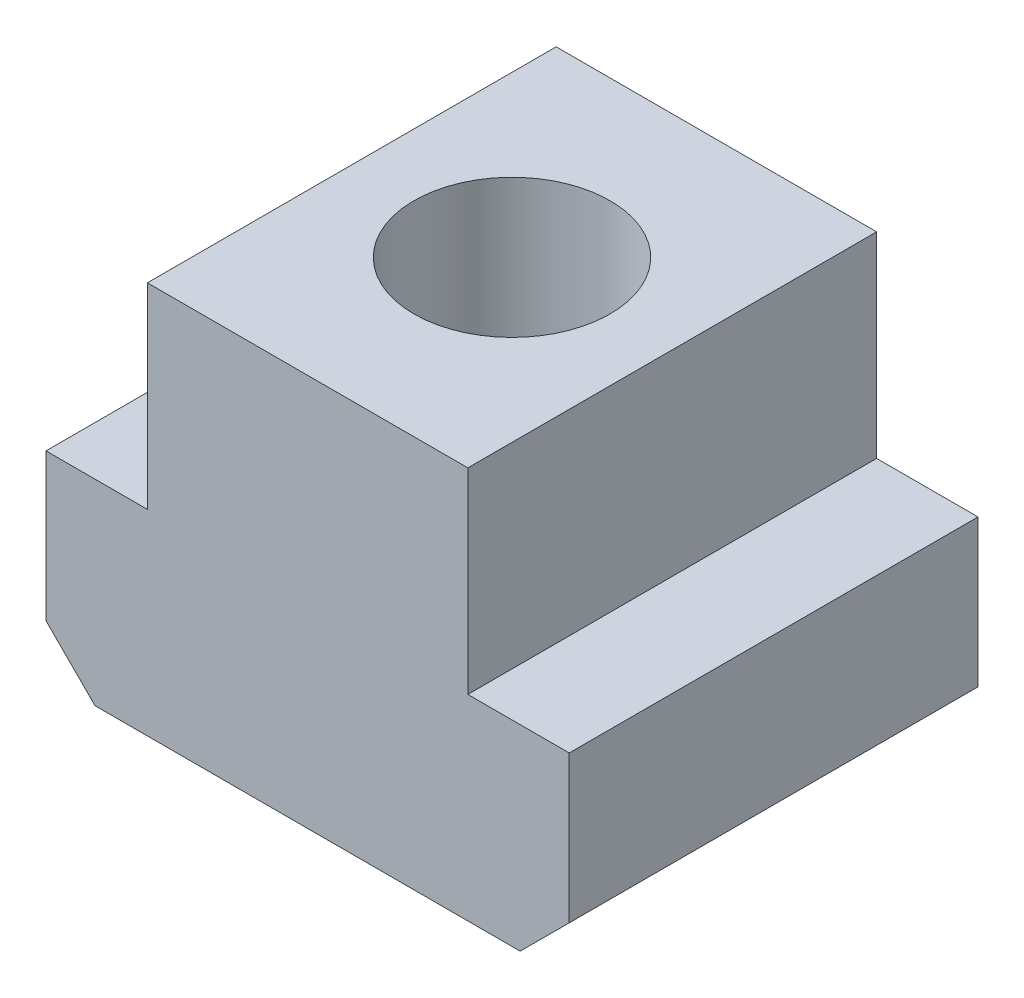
ISO-10303-21;
HEADER;
FILE_DESCRIPTION(('STEP AP214'),'2;1');
FILE_NAME('part.step','',(''),(''),'','','');
FILE_SCHEMA(('AUTOMOTIVE_DESIGN { 1 0 10303 214 1 1 1 1 }'));
ENDSEC;
DATA;
#1=APPLICATION_CONTEXT('core data for automotive mechanical design processes');
#2=APPLICATION_PROTOCOL_DEFINITION('international standard','automotive_design',2000,#1);
#3=PRODUCT_CONTEXT('',#1,'mechanical');
#4=PRODUCT('Part','Part','',(#3));
#5=PRODUCT_RELATED_PRODUCT_CATEGORY('part','',(#4));
#6=PRODUCT_DEFINITION_FORMATION('','',#4);
#7=PRODUCT_DEFINITION_CONTEXT('part definition',#1,'design');
#8=PRODUCT_DEFINITION('design','',#6,#7);
#9=PRODUCT_DEFINITION_SHAPE('','',#8);
#10=(LENGTH_UNIT() NAMED_UNIT(*) SI_UNIT(.MILLI.,.METRE.));
#11=(NAMED_UNIT(*) PLANE_ANGLE_UNIT() SI_UNIT($,.RADIAN.));
#12=(NAMED_UNIT(*) SI_UNIT($,.STERADIAN.) SOLID_ANGLE_UNIT());
#13=UNCERTAINTY_MEASURE_WITH_UNIT(LENGTH_MEASURE(1.E-05),#10,'distance_accuracy_value','');
#14=(GEOMETRIC_REPRESENTATION_CONTEXT(3) GLOBAL_UNCERTAINTY_ASSIGNED_CONTEXT((#13)) GLOBAL_UNIT_ASSIGNED_CONTEXT((#10,
#11,#12)) REPRESENTATION_CONTEXT('',''));
#15=CARTESIAN_POINT('',(0.,0.,0.));
#16=DIRECTION('',(0.,0.,1.));
#17=DIRECTION('',(1.,0.,0.));
#18=AXIS2_PLACEMENT_3D('',#15,#16,#17);
#19=CARTESIAN_POINT('',(-16.,12.,25.));
#20=DIRECTION('',(0.,-1.,0.));
#21=DIRECTION('',(0.,0.,-1.));
#22=AXIS2_PLACEMENT_3D('',#19,#20,#21);
#23=PLANE('',#22);
#24=CARTESIAN_POINT('',(0.,12.,12.5));
#25=DIRECTION('',(0.,1.,0.));
#26=DIRECTION('',(0.,0.,1.));
#27=AXIS2_PLACEMENT_3D('',#24,#25,#26);
#28=CIRCLE('',#27,6.);
#29=CARTESIAN_POINT('',(0.,12.,18.5));
#30=VERTEX_POINT('',#29);
#31=EDGE_CURVE('E195',#30,#30,#28,.T.);
#32=ORIENTED_EDGE('',*,*,#31,.F.);
#33=EDGE_LOOP('',(#32));
#34=FACE_BOUND('',#33,.T.);
#35=DIRECTION('',(0.,0.,-1.));
#36=VECTOR('',#35,1.);
#37=CARTESIAN_POINT('',(-9.8,12.,0.));
#38=LINE('',#37,#36);
#39=CARTESIAN_POINT('',(-9.8,12.,0.));
#40=VERTEX_POINT('',#39);
#41=CARTESIAN_POINT('',(-9.8,12.,25.));
#42=VERTEX_POINT('',#41);
#43=EDGE_CURVE('E159',#40,#42,#38,.F.);
#44=ORIENTED_EDGE('',*,*,#43,.T.);
#45=DIRECTION('',(1.,0.,0.));
#46=VECTOR('',#45,1.);
#47=CARTESIAN_POINT('',(-16.,12.,25.));
#48=LINE('',#47,#46);
#49=CARTESIAN_POINT('',(9.8,12.,25.));
#50=VERTEX_POINT('',#49);
#51=EDGE_CURVE('E25',#42,#50,#48,.T.);
#52=ORIENTED_EDGE('',*,*,#51,.T.);
#53=DIRECTION('',(0.,0.,-1.));
#54=VECTOR('',#53,1.);
#55=CARTESIAN_POINT('',(9.8,12.,25.));
#56=LINE('',#55,#54);
#57=CARTESIAN_POINT('',(9.8,12.,0.));
#58=VERTEX_POINT('',#57);
#59=EDGE_CURVE('E114',#58,#50,#56,.F.);
#60=ORIENTED_EDGE('',*,*,#59,.F.);
#61=DIRECTION('',(-1.,0.,0.));
#62=VECTOR('',#61,1.);
#63=CARTESIAN_POINT('',(-16.,12.,0.));
#64=LINE('',#63,#62);
#65=EDGE_CURVE('E145',#40,#58,#64,.F.);
#66=ORIENTED_EDGE('',*,*,#65,.F.);
#67=EDGE_LOOP('',(#44,#52,#60,#66));
#68=FACE_BOUND('',#67,.T.);
#69=ADVANCED_FACE('F17',(#34,#68),#23,.F.);
#70=CARTESIAN_POINT('',(-16.,-12.,25.));
#71=DIRECTION('',(0.,1.,0.));
#72=DIRECTION('',(0.,0.,1.));
#73=AXIS2_PLACEMENT_3D('',#70,#71,#72);
#74=PLANE('',#73);
#75=CARTESIAN_POINT('',(0.,-12.,12.5));
#76=DIRECTION('',(0.,1.,0.));
#77=DIRECTION('',(0.,0.,1.));
#78=AXIS2_PLACEMENT_3D('',#75,#76,#77);
#79=CIRCLE('',#78,6.);
#80=CARTESIAN_POINT('',(0.,-12.,18.5));
#81=VERTEX_POINT('',#80);
#82=EDGE_CURVE('E198',#81,#81,#79,.T.);
#83=ORIENTED_EDGE('',*,*,#82,.T.);
#84=EDGE_LOOP('',(#83));
#85=FACE_BOUND('',#84,.T.);
#86=DIRECTION('',(0.,0.,1.));
#87=VECTOR('',#86,1.);
#88=CARTESIAN_POINT('',(13.,-12.,25.));
#89=LINE('',#88,#87);
#90=CARTESIAN_POINT('',(13.,-12.,0.));
#91=VERTEX_POINT('',#90);
#92=CARTESIAN_POINT('',(13.,-12.,25.));
#93=VERTEX_POINT('',#92);
#94=EDGE_CURVE('E192',#91,#93,#89,.T.);
#95=ORIENTED_EDGE('',*,*,#94,.T.);
#96=DIRECTION('',(1.,0.,0.));
#97=VECTOR('',#96,1.);
#98=CARTESIAN_POINT('',(-16.,-12.,25.));
#99=LINE('',#98,#97);
#100=CARTESIAN_POINT('',(-13.,-12.,25.));
#101=VERTEX_POINT('',#100);
#102=EDGE_CURVE('E113',#101,#93,#99,.T.);
#103=ORIENTED_EDGE('',*,*,#102,.F.);
#104=DIRECTION('',(0.,0.,1.));
#105=VECTOR('',#104,1.);
#106=CARTESIAN_POINT('',(-13.,-12.,25.));
#107=LINE('',#106,#105);
#108=CARTESIAN_POINT('',(-13.,-12.,0.));
#109=VERTEX_POINT('',#108);
#110=EDGE_CURVE('E103',#101,#109,#107,.F.);
#111=ORIENTED_EDGE('',*,*,#110,.T.);
#112=DIRECTION('',(-1.,0.,0.));
#113=VECTOR('',#112,1.);
#114=CARTESIAN_POINT('',(-16.,-12.,0.));
#115=LINE('',#114,#113);
#116=EDGE_CURVE('E11',#109,#91,#115,.F.);
#117=ORIENTED_EDGE('',*,*,#116,.T.);
#118=EDGE_LOOP('',(#95,#103,#111,#117));
#119=FACE_BOUND('',#118,.T.);
#120=ADVANCED_FACE('F206',(#85,#119),#74,.F.);
#121=CARTESIAN_POINT('',(-16.,-12.,0.));
#122=DIRECTION('',(0.,0.,1.));
#123=DIRECTION('',(1.,0.,0.));
#124=AXIS2_PLACEMENT_3D('',#121,#122,#123);
#125=PLANE('',#124);
#126=DIRECTION('',(1.,0.,0.));
#127=VECTOR('',#126,1.);
#128=CARTESIAN_POINT('',(-16.,0.,0.));
#129=LINE('',#128,#127);
#130=CARTESIAN_POINT('',(-9.8,0.,0.));
#131=VERTEX_POINT('',#130);
#132=CARTESIAN_POINT('',(-16.,0.,0.));
#133=VERTEX_POINT('',#132);
#134=EDGE_CURVE('E142',#131,#133,#129,.F.);
#135=ORIENTED_EDGE('',*,*,#134,.F.);
#136=DIRECTION('',(0.,-1.,0.));
#137=VECTOR('',#136,1.);
#138=CARTESIAN_POINT('',(-9.8,12.,0.));
#139=LINE('',#138,#137);
#140=EDGE_CURVE('E124',#131,#40,#139,.F.);
#141=ORIENTED_EDGE('',*,*,#140,.T.);
#142=ORIENTED_EDGE('',*,*,#65,.T.);
#143=DIRECTION('',(0.,-1.,0.));
#144=VECTOR('',#143,1.);
#145=CARTESIAN_POINT('',(9.8,-12.,0.));
#146=LINE('',#145,#144);
#147=CARTESIAN_POINT('',(9.8,0.,0.));
#148=VERTEX_POINT('',#147);
#149=EDGE_CURVE('E132',#148,#58,#146,.F.);
#150=ORIENTED_EDGE('',*,*,#149,.F.);
#151=DIRECTION('',(-1.,0.,0.));
#152=VECTOR('',#151,1.);
#153=CARTESIAN_POINT('',(16.,0.,0.));
#154=LINE('',#153,#152);
#155=CARTESIAN_POINT('',(16.,0.,0.));
#156=VERTEX_POINT('',#155);
#157=EDGE_CURVE('E139',#148,#156,#154,.F.);
#158=ORIENTED_EDGE('',*,*,#157,.T.);
#159=DIRECTION('',(0.,-1.,0.));
#160=VECTOR('',#159,1.);
#161=CARTESIAN_POINT('',(16.,-12.,0.));
#162=LINE('',#161,#160);
#163=CARTESIAN_POINT('',(16.,-9.,0.));
#164=VERTEX_POINT('',#163);
#165=EDGE_CURVE('E135',#164,#156,#162,.F.);
#166=ORIENTED_EDGE('',*,*,#165,.F.);
#167=DIRECTION('',(-0.707106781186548,-0.707106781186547,0.));
#168=VECTOR('',#167,1.);
#169=CARTESIAN_POINT('',(16.,-9.,0.));
#170=LINE('',#169,#168);
#171=EDGE_CURVE('E32',#164,#91,#170,.T.);
#172=ORIENTED_EDGE('',*,*,#171,.T.);
#173=ORIENTED_EDGE('',*,*,#116,.F.);
#174=DIRECTION('',(-0.707106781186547,0.707106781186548,0.));
#175=VECTOR('',#174,1.);
#176=CARTESIAN_POINT('',(-13.,-12.,0.));
#177=LINE('',#176,#175);
#178=CARTESIAN_POINT('',(-16.,-9.,0.));
#179=VERTEX_POINT('',#178);
#180=EDGE_CURVE('E40',#109,#179,#177,.T.);
#181=ORIENTED_EDGE('',*,*,#180,.T.);
#182=DIRECTION('',(0.,1.,0.));
#183=VECTOR('',#182,1.);
#184=CARTESIAN_POINT('',(-16.,-12.,0.));
#185=LINE('',#184,#183);
#186=EDGE_CURVE('E120',#133,#179,#185,.F.);
#187=ORIENTED_EDGE('',*,*,#186,.F.);
#188=EDGE_LOOP('',(#135,#141,#142,#150,#158,#166,#172,#173,#181,#187));
#189=FACE_BOUND('',#188,.T.);
#190=ADVANCED_FACE('F19',(#189),#125,.F.);
#191=CARTESIAN_POINT('',(16.,12.,25.));
#192=DIRECTION('',(-1.,0.,0.));
#193=DIRECTION('',(0.,-1.,0.));
#194=AXIS2_PLACEMENT_3D('',#191,#192,#193);
#195=PLANE('',#194);
#196=DIRECTION('',(0.,0.,-1.));
#197=VECTOR('',#196,1.);
#198=CARTESIAN_POINT('',(16.,0.,0.));
#199=LINE('',#198,#197);
#200=CARTESIAN_POINT('',(16.,0.,25.));
#201=VERTEX_POINT('',#200);
#202=EDGE_CURVE('E118',#156,#201,#199,.F.);
#203=ORIENTED_EDGE('',*,*,#202,.T.);
#204=DIRECTION('',(0.,1.,0.));
#205=VECTOR('',#204,1.);
#206=CARTESIAN_POINT('',(16.,12.,25.));
#207=LINE('',#206,#205);
#208=CARTESIAN_POINT('',(16.,-9.,25.));
#209=VERTEX_POINT('',#208);
#210=EDGE_CURVE('E110',#209,#201,#207,.T.);
#211=ORIENTED_EDGE('',*,*,#210,.F.);
#212=DIRECTION('',(0.,0.,1.));
#213=VECTOR('',#212,1.);
#214=CARTESIAN_POINT('',(16.,-9.,25.));
#215=LINE('',#214,#213);
#216=EDGE_CURVE('E95',#209,#164,#215,.F.);
#217=ORIENTED_EDGE('',*,*,#216,.T.);
#218=ORIENTED_EDGE('',*,*,#165,.T.);
#219=EDGE_LOOP('',(#203,#211,#217,#218));
#220=FACE_BOUND('',#219,.T.);
#221=ADVANCED_FACE('F117',(#220),#195,.F.);
#222=CARTESIAN_POINT('',(16.,0.,0.));
#223=DIRECTION('',(0.,-1.,0.));
#224=DIRECTION('',(1.,0.,0.));
#225=AXIS2_PLACEMENT_3D('',#222,#223,#224);
#226=PLANE('',#225);
#227=DIRECTION('',(0.,0.,1.));
#228=VECTOR('',#227,1.);
#229=CARTESIAN_POINT('',(9.8,0.,0.));
#230=LINE('',#229,#228);
#231=CARTESIAN_POINT('',(9.8,0.,25.));
#232=VERTEX_POINT('',#231);
#233=EDGE_CURVE('E168',#148,#232,#230,.T.);
#234=ORIENTED_EDGE('',*,*,#233,.T.);
#235=DIRECTION('',(1.,0.,0.));
#236=VECTOR('',#235,1.);
#237=CARTESIAN_POINT('',(-16.,0.,25.));
#238=LINE('',#237,#236);
#239=EDGE_CURVE('E152',#232,#201,#238,.T.);
#240=ORIENTED_EDGE('',*,*,#239,.T.);
#241=ORIENTED_EDGE('',*,*,#202,.F.);
#242=ORIENTED_EDGE('',*,*,#157,.F.);
#243=EDGE_LOOP('',(#234,#240,#241,#242));
#244=FACE_BOUND('',#243,.T.);
#245=ADVANCED_FACE('F204',(#244),#226,.F.);
#246=CARTESIAN_POINT('',(9.8,12.,0.));
#247=DIRECTION('',(-1.,0.,0.));
#248=DIRECTION('',(0.,-1.,0.));
#249=AXIS2_PLACEMENT_3D('',#246,#247,#248);
#250=PLANE('',#249);
#251=ORIENTED_EDGE('',*,*,#59,.T.);
#252=DIRECTION('',(0.,1.,0.));
#253=VECTOR('',#252,1.);
#254=CARTESIAN_POINT('',(9.8,12.,25.));
#255=LINE('',#254,#253);
#256=EDGE_CURVE('E121',#232,#50,#255,.T.);
#257=ORIENTED_EDGE('',*,*,#256,.F.);
#258=ORIENTED_EDGE('',*,*,#233,.F.);
#259=ORIENTED_EDGE('',*,*,#149,.T.);
#260=EDGE_LOOP('',(#251,#257,#258,#259));
#261=FACE_BOUND('',#260,.T.);
#262=ADVANCED_FACE('F162',(#261),#250,.F.);
#263=CARTESIAN_POINT('',(-9.8,12.,0.));
#264=DIRECTION('',(1.,0.,0.));
#265=DIRECTION('',(0.,1.,0.));
#266=AXIS2_PLACEMENT_3D('',#263,#264,#265);
#267=PLANE('',#266);
#268=DIRECTION('',(0.,0.,-1.));
#269=VECTOR('',#268,1.);
#270=CARTESIAN_POINT('',(-9.8,0.,0.));
#271=LINE('',#270,#269);
#272=CARTESIAN_POINT('',(-9.8,0.,25.));
#273=VERTEX_POINT('',#272);
#274=EDGE_CURVE('E176',#131,#273,#271,.F.);
#275=ORIENTED_EDGE('',*,*,#274,.T.);
#276=DIRECTION('',(0.,1.,0.));
#277=VECTOR('',#276,1.);
#278=CARTESIAN_POINT('',(-9.8,-12.,25.));
#279=LINE('',#278,#277);
#280=EDGE_CURVE('E126',#273,#42,#279,.T.);
#281=ORIENTED_EDGE('',*,*,#280,.T.);
#282=ORIENTED_EDGE('',*,*,#43,.F.);
#283=ORIENTED_EDGE('',*,*,#140,.F.);
#284=EDGE_LOOP('',(#275,#281,#282,#283));
#285=FACE_BOUND('',#284,.T.);
#286=ADVANCED_FACE('F174',(#285),#267,.F.);
#287=CARTESIAN_POINT('',(-16.,0.,0.));
#288=DIRECTION('',(0.,-1.,0.));
#289=DIRECTION('',(0.,0.,-1.));
#290=AXIS2_PLACEMENT_3D('',#287,#288,#289);
#291=PLANE('',#290);
#292=DIRECTION('',(0.,0.,-1.));
#293=VECTOR('',#292,1.);
#294=CARTESIAN_POINT('',(-16.,0.,25.));
#295=LINE('',#294,#293);
#296=CARTESIAN_POINT('',(-16.,0.,25.));
#297=VERTEX_POINT('',#296);
#298=EDGE_CURVE('E165',#133,#297,#295,.F.);
#299=ORIENTED_EDGE('',*,*,#298,.T.);
#300=DIRECTION('',(-1.,0.,0.));
#301=VECTOR('',#300,1.);
#302=CARTESIAN_POINT('',(-16.,0.,25.));
#303=LINE('',#302,#301);
#304=EDGE_CURVE('E149',#273,#297,#303,.T.);
#305=ORIENTED_EDGE('',*,*,#304,.F.);
#306=ORIENTED_EDGE('',*,*,#274,.F.);
#307=ORIENTED_EDGE('',*,*,#134,.T.);
#308=EDGE_LOOP('',(#299,#305,#306,#307));
#309=FACE_BOUND('',#308,.T.);
#310=ADVANCED_FACE('F180',(#309),#291,.F.);
#311=CARTESIAN_POINT('',(-16.,12.,25.));
#312=DIRECTION('',(1.,0.,0.));
#313=DIRECTION('',(0.,0.,-1.));
#314=AXIS2_PLACEMENT_3D('',#311,#312,#313);
#315=PLANE('',#314);
#316=DIRECTION('',(0.,0.,1.));
#317=VECTOR('',#316,1.);
#318=CARTESIAN_POINT('',(-16.,-9.,25.));
#319=LINE('',#318,#317);
#320=CARTESIAN_POINT('',(-16.,-9.,25.));
#321=VERTEX_POINT('',#320);
#322=EDGE_CURVE('E186',#179,#321,#319,.T.);
#323=ORIENTED_EDGE('',*,*,#322,.T.);
#324=DIRECTION('',(0.,1.,0.));
#325=VECTOR('',#324,1.);
#326=CARTESIAN_POINT('',(-16.,-12.,25.));
#327=LINE('',#326,#325);
#328=EDGE_CURVE('E137',#321,#297,#327,.T.);
#329=ORIENTED_EDGE('',*,*,#328,.T.);
#330=ORIENTED_EDGE('',*,*,#298,.F.);
#331=ORIENTED_EDGE('',*,*,#186,.T.);
#332=EDGE_LOOP('',(#323,#329,#330,#331));
#333=FACE_BOUND('',#332,.T.);
#334=ADVANCED_FACE('F184',(#333),#315,.F.);
#335=CARTESIAN_POINT('',(-13.,-12.,25.));
#336=DIRECTION('',(0.707106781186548,0.707106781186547,0.));
#337=DIRECTION('',(-0.707106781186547,0.707106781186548,0.));
#338=AXIS2_PLACEMENT_3D('',#335,#336,#337);
#339=PLANE('',#338);
#340=ORIENTED_EDGE('',*,*,#110,.F.);
#341=DIRECTION('',(0.707106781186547,-0.707106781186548,0.));
#342=VECTOR('',#341,1.);
#343=CARTESIAN_POINT('',(-15.5,-9.5,25.));
#344=LINE('',#343,#342);
#345=EDGE_CURVE('E115',#321,#101,#344,.T.);
#346=ORIENTED_EDGE('',*,*,#345,.F.);
#347=ORIENTED_EDGE('',*,*,#322,.F.);
#348=ORIENTED_EDGE('',*,*,#180,.F.);
#349=EDGE_LOOP('',(#340,#346,#347,#348));
#350=FACE_BOUND('',#349,.T.);
#351=ADVANCED_FACE('F207',(#350),#339,.F.);
#352=CARTESIAN_POINT('',(16.,-9.,25.));
#353=DIRECTION('',(-0.707106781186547,0.707106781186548,0.));
#354=DIRECTION('',(-0.707106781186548,-0.707106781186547,0.));
#355=AXIS2_PLACEMENT_3D('',#352,#353,#354);
#356=PLANE('',#355);
#357=DIRECTION('',(0.707106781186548,0.707106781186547,0.));
#358=VECTOR('',#357,1.);
#359=CARTESIAN_POINT('',(13.5,-11.5,25.));
#360=LINE('',#359,#358);
#361=EDGE_CURVE('E98',#93,#209,#360,.T.);
#362=ORIENTED_EDGE('',*,*,#361,.F.);
#363=ORIENTED_EDGE('',*,*,#94,.F.);
#364=ORIENTED_EDGE('',*,*,#171,.F.);
#365=ORIENTED_EDGE('',*,*,#216,.F.);
#366=EDGE_LOOP('',(#362,#363,#364,#365));
#367=FACE_BOUND('',#366,.T.);
#368=ADVANCED_FACE('F97',(#367),#356,.F.);
#369=CARTESIAN_POINT('',(-16.,-12.,25.));
#370=DIRECTION('',(0.,0.,1.));
#371=DIRECTION('',(1.,0.,0.));
#372=AXIS2_PLACEMENT_3D('',#369,#370,#371);
#373=PLANE('',#372);
#374=ORIENTED_EDGE('',*,*,#280,.F.);
#375=ORIENTED_EDGE('',*,*,#304,.T.);
#376=ORIENTED_EDGE('',*,*,#328,.F.);
#377=ORIENTED_EDGE('',*,*,#345,.T.);
#378=ORIENTED_EDGE('',*,*,#102,.T.);
#379=ORIENTED_EDGE('',*,*,#361,.T.);
#380=ORIENTED_EDGE('',*,*,#210,.T.);
#381=ORIENTED_EDGE('',*,*,#239,.F.);
#382=ORIENTED_EDGE('',*,*,#256,.T.);
#383=ORIENTED_EDGE('',*,*,#51,.F.);
#384=EDGE_LOOP('',(#374,#375,#376,#377,#378,#379,#380,#381,#382,#383));
#385=FACE_BOUND('',#384,.T.);
#386=ADVANCED_FACE('F108',(#385),#373,.T.);
#387=CARTESIAN_POINT('',(0.,-12.,12.5));
#388=DIRECTION('',(0.,1.,0.));
#389=DIRECTION('',(0.,0.,1.));
#390=AXIS2_PLACEMENT_3D('',#387,#388,#389);
#391=CYLINDRICAL_SURFACE('',#390,6.);
#392=ORIENTED_EDGE('',*,*,#82,.F.);
#393=EDGE_LOOP('',(#392));
#394=FACE_BOUND('',#393,.T.);
#395=ORIENTED_EDGE('',*,*,#31,.T.);
#396=EDGE_LOOP('',(#395));
#397=FACE_BOUND('',#396,.T.);
#398=ADVANCED_FACE('F238',(#394,#397),#391,.F.);
#399=CLOSED_SHELL('',(#69,#120,#190,#221,#245,#262,#286,#310,#334,#351,#368,#386,#398));
#400=MANIFOLD_SOLID_BREP('B1',#399);
#401=ADVANCED_BREP_SHAPE_REPRESENTATION('',(#18,#400),#14);
#402=SHAPE_DEFINITION_REPRESENTATION(#9,#401);
ENDSEC;
END-ISO-10303-21;
